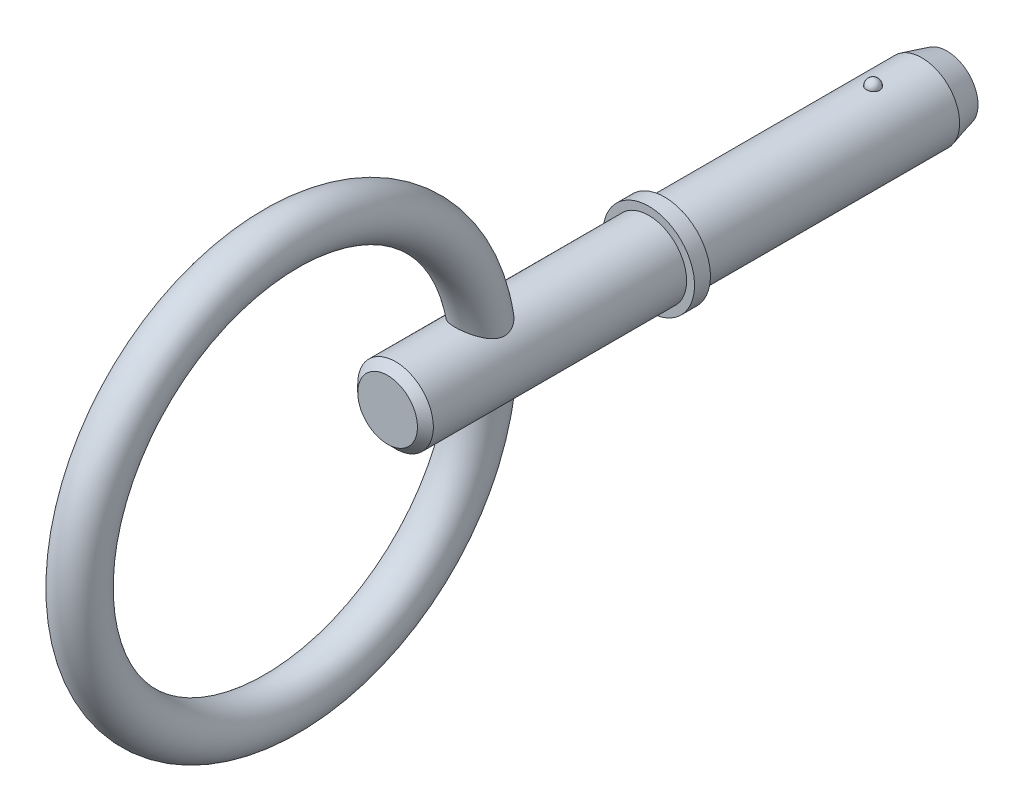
ISO-10303-21;
HEADER;
FILE_DESCRIPTION(('STEP AP214'),'2;1');
FILE_NAME('part.step','',(''),(''),'','','');
FILE_SCHEMA(('AUTOMOTIVE_DESIGN { 1 0 10303 214 1 1 1 1 }'));
ENDSEC;
DATA;
#1=APPLICATION_CONTEXT('core data for automotive mechanical design processes');
#2=APPLICATION_PROTOCOL_DEFINITION('international standard','automotive_design',2000,#1);
#3=PRODUCT_CONTEXT('',#1,'mechanical');
#4=PRODUCT('Part','Part','',(#3));
#5=PRODUCT_RELATED_PRODUCT_CATEGORY('part','',(#4));
#6=PRODUCT_DEFINITION_FORMATION('','',#4);
#7=PRODUCT_DEFINITION_CONTEXT('part definition',#1,'design');
#8=PRODUCT_DEFINITION('design','',#6,#7);
#9=PRODUCT_DEFINITION_SHAPE('','',#8);
#10=(LENGTH_UNIT() NAMED_UNIT(*) SI_UNIT(.MILLI.,.METRE.));
#11=(NAMED_UNIT(*) PLANE_ANGLE_UNIT() SI_UNIT($,.RADIAN.));
#12=(NAMED_UNIT(*) SI_UNIT($,.STERADIAN.) SOLID_ANGLE_UNIT());
#13=UNCERTAINTY_MEASURE_WITH_UNIT(LENGTH_MEASURE(1.E-05),#10,'distance_accuracy_value','');
#14=(GEOMETRIC_REPRESENTATION_CONTEXT(3) GLOBAL_UNCERTAINTY_ASSIGNED_CONTEXT((#13)) GLOBAL_UNIT_ASSIGNED_CONTEXT((#10,
#11,#12)) REPRESENTATION_CONTEXT('',''));
#15=CARTESIAN_POINT('',(0.,0.,0.));
#16=DIRECTION('',(0.,0.,1.));
#17=DIRECTION('',(1.,0.,0.));
#18=AXIS2_PLACEMENT_3D('',#15,#16,#17);
#19=CARTESIAN_POINT('',(0.,0.,12.7));
#20=DIRECTION('',(0.,0.,-1.));
#21=DIRECTION('',(-1.,0.,0.));
#22=AXIS2_PLACEMENT_3D('',#19,#20,#21);
#23=CYLINDRICAL_SURFACE('',#22,2.38);
#24=CARTESIAN_POINT('',(0.418361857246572,2.34294117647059,-0.419999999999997));
#25=CARTESIAN_POINT('',(0.418361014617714,2.34294160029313,-0.396453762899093));
#26=CARTESIAN_POINT('',(0.416399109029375,2.34329426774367,-0.372895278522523));
#27=CARTESIAN_POINT('',(0.408599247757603,2.34466666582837,-0.32643458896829));
#28=CARTESIAN_POINT('',(0.402757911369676,2.34568697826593,-0.303532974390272));
#29=CARTESIAN_POINT('',(0.387358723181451,2.3482789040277,-0.259059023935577));
#30=CARTESIAN_POINT('',(0.377802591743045,2.34985026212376,-0.237486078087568));
#31=CARTESIAN_POINT('',(0.355233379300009,2.35336760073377,-0.196270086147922));
#32=CARTESIAN_POINT('',(0.34222083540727,2.3553135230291,-0.176626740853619));
#33=CARTESIAN_POINT('',(0.313060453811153,2.35936636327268,-0.139777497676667));
#34=CARTESIAN_POINT('',(0.296906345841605,2.36147359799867,-0.122576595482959));
#35=CARTESIAN_POINT('',(0.261921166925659,2.3656092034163,-0.0911421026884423));
#36=CARTESIAN_POINT('',(0.243090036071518,2.36763757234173,-0.0769085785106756));
#37=CARTESIAN_POINT('',(0.203297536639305,2.37138533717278,-0.0518262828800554));
#38=CARTESIAN_POINT('',(0.182338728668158,2.37310509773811,-0.0409735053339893));
#39=CARTESIAN_POINT('',(0.138864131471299,2.37604521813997,-0.0229395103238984));
#40=CARTESIAN_POINT('',(0.116348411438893,2.37726560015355,-0.0157581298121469));
#41=CARTESIAN_POINT('',(0.0705754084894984,2.37906276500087,-0.00531205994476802));
#42=CARTESIAN_POINT('',(0.0473247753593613,2.37964420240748,-0.00201903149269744));
#43=CARTESIAN_POINT('',(0.000593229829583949,2.38011460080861,0.000651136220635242));
#44=CARTESIAN_POINT('',(-0.0228876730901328,2.38000359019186,2.84360175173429E-05));
#45=CARTESIAN_POINT('',(-0.0692686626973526,2.37910422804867,-0.00509943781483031));
#46=CARTESIAN_POINT('',(-0.0921713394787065,2.37831983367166,-0.00958192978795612));
#47=CARTESIAN_POINT('',(-0.136890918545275,2.37616546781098,-0.022272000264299));
#48=CARTESIAN_POINT('',(-0.158707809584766,2.37479549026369,-0.0304796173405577));
#49=CARTESIAN_POINT('',(-0.200704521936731,2.37161607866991,-0.0504168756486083));
#50=CARTESIAN_POINT('',(-0.220879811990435,2.36980547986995,-0.0621558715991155));
#51=CARTESIAN_POINT('',(-0.258974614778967,2.36594575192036,-0.0888218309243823));
#52=CARTESIAN_POINT('',(-0.276894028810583,2.36389661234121,-0.103748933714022));
#53=CARTESIAN_POINT('',(-0.310124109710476,2.35976825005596,-0.136509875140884));
#54=CARTESIAN_POINT('',(-0.325413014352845,2.35768891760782,-0.154365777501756));
#55=CARTESIAN_POINT('',(-0.352793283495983,2.35374782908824,-0.192402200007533));
#56=CARTESIAN_POINT('',(-0.364884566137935,2.35188607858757,-0.212582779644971));
#57=CARTESIAN_POINT('',(-0.385587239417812,2.34858114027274,-0.254794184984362));
#58=CARTESIAN_POINT('',(-0.394183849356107,2.34713973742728,-0.276832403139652));
#59=CARTESIAN_POINT('',(-0.407590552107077,2.3448489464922,-0.322061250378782));
#60=CARTESIAN_POINT('',(-0.412400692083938,2.34399955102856,-0.34525186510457));
#61=CARTESIAN_POINT('',(-0.418098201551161,2.34299005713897,-0.392078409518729));
#62=CARTESIAN_POINT('',(-0.41899328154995,2.34282860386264,-0.415713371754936));
#63=CARTESIAN_POINT('',(-0.416857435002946,2.34320955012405,-0.462799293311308));
#64=CARTESIAN_POINT('',(-0.413826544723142,2.34375194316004,-0.486250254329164));
#65=CARTESIAN_POINT('',(-0.403929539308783,2.34547773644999,-0.532261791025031));
#66=CARTESIAN_POINT('',(-0.397069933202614,2.34666004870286,-0.554823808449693));
#67=CARTESIAN_POINT('',(-0.379705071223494,2.34953208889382,-0.59846383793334));
#68=CARTESIAN_POINT('',(-0.369199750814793,2.35122182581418,-0.61954182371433));
#69=CARTESIAN_POINT('',(-0.344797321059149,2.35492396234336,-0.659671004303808));
#70=CARTESIAN_POINT('',(-0.33089223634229,2.35693711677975,-0.678717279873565));
#71=CARTESIAN_POINT('',(-0.300080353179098,2.36105754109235,-0.714192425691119));
#72=CARTESIAN_POINT('',(-0.283173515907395,2.36316481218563,-0.730621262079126));
#73=CARTESIAN_POINT('',(-0.246801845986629,2.36723962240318,-0.760416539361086));
#74=CARTESIAN_POINT('',(-0.227334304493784,2.36920701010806,-0.773779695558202));
#75=CARTESIAN_POINT('',(-0.186398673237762,2.37277833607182,-0.797042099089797));
#76=CARTESIAN_POINT('',(-0.164930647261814,2.37438228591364,-0.806941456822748));
#77=CARTESIAN_POINT('',(-0.120727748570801,2.37703848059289,-0.82294821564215));
#78=CARTESIAN_POINT('',(-0.0980005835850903,2.37809374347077,-0.829076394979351));
#79=CARTESIAN_POINT('',(-0.0518218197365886,2.37954782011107,-0.837451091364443));
#80=CARTESIAN_POINT('',(-0.0283702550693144,2.37994666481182,-0.839697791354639));
#81=CARTESIAN_POINT('',(0.0184023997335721,2.38004290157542,-0.840243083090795));
#82=CARTESIAN_POINT('',(0.0417231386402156,2.37974556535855,-0.838571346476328));
#83=CARTESIAN_POINT('',(0.0877471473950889,2.37849333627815,-0.831389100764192));
#84=CARTESIAN_POINT('',(0.110450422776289,2.37753844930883,-0.825878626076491));
#85=CARTESIAN_POINT('',(0.154584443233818,2.37507730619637,-0.811179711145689));
#86=CARTESIAN_POINT('',(0.17601599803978,2.37357140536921,-0.801993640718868));
#87=CARTESIAN_POINT('',(0.217028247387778,2.37017355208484,-0.780200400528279));
#88=CARTESIAN_POINT('',(0.236608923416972,2.36828159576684,-0.767593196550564));
#89=CARTESIAN_POINT('',(0.27351405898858,2.36430486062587,-0.739207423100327));
#90=CARTESIAN_POINT('',(0.290821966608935,2.36221883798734,-0.723407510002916));
#91=CARTESIAN_POINT('',(0.322554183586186,2.3580957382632,-0.68912612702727));
#92=CARTESIAN_POINT('',(0.336977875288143,2.35605867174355,-0.670644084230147));
#93=CARTESIAN_POINT('',(0.362636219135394,2.35224677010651,-0.63138169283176));
#94=CARTESIAN_POINT('',(0.373848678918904,2.35047379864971,-0.610586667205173));
#95=CARTESIAN_POINT('',(0.392641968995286,2.34740786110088,-0.567397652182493));
#96=CARTESIAN_POINT('',(0.400225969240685,2.34611447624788,-0.545005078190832));
#97=CARTESIAN_POINT('',(0.410033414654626,2.34441668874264,-0.505456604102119));
#98=CARTESIAN_POINT('',(0.413152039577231,2.34386644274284,-0.488523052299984));
#99=CARTESIAN_POINT('',(0.417316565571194,2.34312853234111,-0.454395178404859));
#100=CARTESIAN_POINT('',(0.418362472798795,2.34294086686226,-0.437200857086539));
#101=CARTESIAN_POINT('',(0.418361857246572,2.34294117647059,-0.419999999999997));
#102=B_SPLINE_CURVE_WITH_KNOTS('',3,(#24,#25,#26,#27,#28,#29,#30,#31,#32,#33,#34,#35,#36,#37,
#38,#39,#40,#41,#42,#43,#44,#45,#46,#47,#48,#49,#50,#51,#52,#53,#54,#55,#56,#57,#58,#59,#60,#61,
#62,#63,#64,#65,#66,#67,#68,#69,#70,#71,#72,#73,#74,#75,#76,#77,#78,#79,#80,#81,#82,#83,#84,#85,
#86,#87,#88,#89,#90,#91,#92,#93,#94,#95,#96,#97,#98,#99,#100,#101),.UNSPECIFIED.,.T.,.F.,(4,2,2,
2,2,2,2,2,2,2,2,2,2,2,2,2,2,2,2,2,2,2,2,2,2,2,2,2,2,2,2,2,2,2,2,2,2,2,4),(0.,0.0705763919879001,
0.141214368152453,0.211819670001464,0.282414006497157,0.353150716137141,0.423889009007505,
0.494543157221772,0.565194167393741,0.635327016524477,0.705456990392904,0.77517764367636,
0.844899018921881,0.914806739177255,0.98471751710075,1.05518143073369,1.1256471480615,
1.19640787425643,1.26716771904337,1.33778814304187,1.40840791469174,1.47890799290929,
1.54940931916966,1.62007764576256,1.69074688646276,1.76149149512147,1.83223384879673,
1.90258285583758,1.97292854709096,2.04274328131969,2.11255738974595,2.18232655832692,
2.25209642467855,2.32234913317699,2.39261687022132,2.4633591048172,2.5340394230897,
2.58559662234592,2.63715366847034),.UNSPECIFIED.);
#103=CARTESIAN_POINT('',(0.418361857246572,2.34294117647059,-0.419999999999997));
#104=VERTEX_POINT('',#103);
#105=EDGE_CURVE('E102',#104,#104,#102,.T.);
#106=ORIENTED_EDGE('',*,*,#105,.T.);
#107=EDGE_LOOP('',(#106));
#108=FACE_BOUND('',#107,.T.);
#109=CARTESIAN_POINT('',(0.,0.,-3.49399999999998));
#110=DIRECTION('',(0.,0.,-1.));
#111=DIRECTION('',(-1.,0.,0.));
#112=AXIS2_PLACEMENT_3D('',#109,#110,#111);
#113=CIRCLE('',#112,2.38);
#114=CARTESIAN_POINT('',(-2.38,0.,-3.49399999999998));
#115=VERTEX_POINT('',#114);
#116=EDGE_CURVE('E110',#115,#115,#113,.F.);
#117=ORIENTED_EDGE('',*,*,#116,.T.);
#118=EDGE_LOOP('',(#117));
#119=FACE_BOUND('',#118,.T.);
#120=CARTESIAN_POINT('',(0.,0.,12.7));
#121=DIRECTION('',(0.,0.,1.));
#122=DIRECTION('',(1.,0.,0.));
#123=AXIS2_PLACEMENT_3D('',#120,#121,#122);
#124=CIRCLE('',#123,2.38);
#125=CARTESIAN_POINT('',(2.38,0.,12.7));
#126=VERTEX_POINT('',#125);
#127=EDGE_CURVE('E108',#126,#126,#124,.T.);
#128=ORIENTED_EDGE('',*,*,#127,.F.);
#129=EDGE_LOOP('',(#128));
#130=FACE_BOUND('',#129,.T.);
#131=ADVANCED_FACE('F39',(#108,#119,#130),#23,.T.);
#132=CARTESIAN_POINT('',(0.,0.,-5.08));
#133=DIRECTION('',(0.,0.,-1.));
#134=DIRECTION('',(-1.,0.,0.));
#135=AXIS2_PLACEMENT_3D('',#132,#133,#134);
#136=PLANE('',#135);
#137=CARTESIAN_POINT('',(0.,0.,-5.08));
#138=DIRECTION('',(0.,0.,-1.));
#139=DIRECTION('',(-1.,0.,0.));
#140=AXIS2_PLACEMENT_3D('',#137,#138,#139);
#141=CIRCLE('',#140,1.95503258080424);
#142=CARTESIAN_POINT('',(-1.95503258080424,0.,-5.08));
#143=VERTEX_POINT('',#142);
#144=EDGE_CURVE('E142',#143,#143,#141,.T.);
#145=ORIENTED_EDGE('',*,*,#144,.T.);
#146=EDGE_LOOP('',(#145));
#147=FACE_BOUND('',#146,.T.);
#148=ADVANCED_FACE('F88',(#147),#136,.T.);
#149=CARTESIAN_POINT('',(0.,0.,-5.08));
#150=DIRECTION('',(0.,0.,1.));
#151=DIRECTION('',(1.,0.,0.));
#152=AXIS2_PLACEMENT_3D('',#149,#150,#151);
#153=CONICAL_SURFACE('',#152,1.95503258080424,0.261799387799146);
#154=ORIENTED_EDGE('',*,*,#116,.F.);
#155=EDGE_LOOP('',(#154));
#156=FACE_BOUND('',#155,.T.);
#157=ORIENTED_EDGE('',*,*,#144,.F.);
#158=EDGE_LOOP('',(#157));
#159=FACE_BOUND('',#158,.T.);
#160=ADVANCED_FACE('F94',(#156,#159),#153,.T.);
#161=CARTESIAN_POINT('',(0.,2.38,-0.419999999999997));
#162=DIRECTION('',(0.,1.,0.));
#163=DIRECTION('',(0.,0.,1.));
#164=AXIS2_PLACEMENT_3D('',#161,#162,#163);
#165=SPHERICAL_SURFACE('',#164,0.419999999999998);
#166=ORIENTED_EDGE('',*,*,#105,.F.);
#167=EDGE_LOOP('',(#166));
#168=FACE_BOUND('',#167,.T.);
#169=ADVANCED_FACE('F113',(#168),#165,.T.);
#170=CARTESIAN_POINT('',(0.,0.,12.7));
#171=DIRECTION('',(0.,0.,-1.));
#172=DIRECTION('',(-1.,0.,0.));
#173=AXIS2_PLACEMENT_3D('',#170,#171,#172);
#174=PLANE('',#173);
#175=ORIENTED_EDGE('',*,*,#127,.T.);
#176=EDGE_LOOP('',(#175));
#177=FACE_BOUND('',#176,.T.);
#178=CARTESIAN_POINT('',(0.,0.,12.7));
#179=DIRECTION('',(0.,0.,-1.));
#180=DIRECTION('',(-1.,0.,0.));
#181=AXIS2_PLACEMENT_3D('',#178,#179,#180);
#182=CIRCLE('',#181,2.88);
#183=CARTESIAN_POINT('',(-2.88,0.,12.7));
#184=VERTEX_POINT('',#183);
#185=EDGE_CURVE('E109',#184,#184,#182,.T.);
#186=ORIENTED_EDGE('',*,*,#185,.T.);
#187=EDGE_LOOP('',(#186));
#188=FACE_BOUND('',#187,.T.);
#189=ADVANCED_FACE('F117',(#177,#188),#174,.T.);
#190=CARTESIAN_POINT('',(0.,0.,33.7287874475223));
#191=DIRECTION('',(0.,0.,-1.));
#192=DIRECTION('',(-1.,0.,0.));
#193=AXIS2_PLACEMENT_3D('',#190,#191,#192);
#194=CYLINDRICAL_SURFACE('',#193,2.88);
#195=CARTESIAN_POINT('',(0.,0.,13.7));
#196=DIRECTION('',(0.,0.,-1.));
#197=DIRECTION('',(-1.,0.,0.));
#198=AXIS2_PLACEMENT_3D('',#195,#196,#197);
#199=CIRCLE('',#198,2.88);
#200=CARTESIAN_POINT('',(-2.88,0.,13.7));
#201=VERTEX_POINT('',#200);
#202=EDGE_CURVE('E134',#201,#201,#199,.T.);
#203=ORIENTED_EDGE('',*,*,#202,.T.);
#204=EDGE_LOOP('',(#203));
#205=FACE_BOUND('',#204,.T.);
#206=ORIENTED_EDGE('',*,*,#185,.F.);
#207=EDGE_LOOP('',(#206));
#208=FACE_BOUND('',#207,.T.);
#209=ADVANCED_FACE('F121',(#205,#208),#194,.T.);
#210=CARTESIAN_POINT('',(0.,2.88,13.7));
#211=DIRECTION('',(0.,0.,1.));
#212=DIRECTION('',(1.,0.,0.));
#213=AXIS2_PLACEMENT_3D('',#210,#211,#212);
#214=PLANE('',#213);
#215=CARTESIAN_POINT('',(0.,0.,13.7));
#216=DIRECTION('',(0.,0.,1.));
#217=DIRECTION('',(1.,0.,0.));
#218=AXIS2_PLACEMENT_3D('',#215,#216,#217);
#219=CIRCLE('',#218,2.38);
#220=CARTESIAN_POINT('',(2.38,0.,13.7));
#221=VERTEX_POINT('',#220);
#222=EDGE_CURVE('E112',#221,#221,#219,.T.);
#223=ORIENTED_EDGE('',*,*,#222,.F.);
#224=EDGE_LOOP('',(#223));
#225=FACE_BOUND('',#224,.T.);
#226=ORIENTED_EDGE('',*,*,#202,.F.);
#227=EDGE_LOOP('',(#226));
#228=FACE_BOUND('',#227,.T.);
#229=ADVANCED_FACE('F85',(#225,#228),#214,.T.);
#230=CARTESIAN_POINT('',(0.,0.,30.15));
#231=DIRECTION('',(0.,0.,-1.));
#232=DIRECTION('',(-1.,0.,0.));
#233=AXIS2_PLACEMENT_3D('',#230,#231,#232);
#234=CYLINDRICAL_SURFACE('',#233,2.38);
#235=CARTESIAN_POINT('',(-0.903407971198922,-2.20187511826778,23.128101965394));
#236=CARTESIAN_POINT('',(-0.839710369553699,-2.22800560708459,23.0836275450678));
#237=CARTESIAN_POINT('',(-0.771955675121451,-2.25255828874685,23.0439200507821));
#238=CARTESIAN_POINT('',(-0.629623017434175,-2.29641711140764,22.9749006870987));
#239=CARTESIAN_POINT('',(-0.555034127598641,-2.31571464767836,22.9456058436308));
#240=CARTESIAN_POINT('',(-0.40067374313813,-2.34735542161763,22.8982943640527));
#241=CARTESIAN_POINT('',(-0.320887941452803,-2.35967847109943,22.8803104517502));
#242=CARTESIAN_POINT('',(-0.158738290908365,-2.37609587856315,22.8564617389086));
#243=CARTESIAN_POINT('',(-0.0763765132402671,-2.38019668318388,22.8505874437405));
#244=CARTESIAN_POINT('',(0.0836658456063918,-2.3797998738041,22.8511603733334));
#245=CARTESIAN_POINT('',(0.161351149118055,-2.37576936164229,22.8569382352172));
#246=CARTESIAN_POINT('',(0.314409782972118,-2.36039486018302,22.8792676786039));
#247=CARTESIAN_POINT('',(0.389782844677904,-2.34905002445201,22.8958205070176));
#248=CARTESIAN_POINT('',(0.535937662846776,-2.32006569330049,22.9390515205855));
#249=CARTESIAN_POINT('',(0.606735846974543,-2.30245039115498,22.9656908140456));
#250=CARTESIAN_POINT('',(0.742521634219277,-2.26231731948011,23.0283720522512));
#251=CARTESIAN_POINT('',(0.807508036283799,-2.23979853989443,23.0644159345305));
#252=CARTESIAN_POINT('',(0.935326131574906,-2.18966592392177,23.1483563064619));
#253=CARTESIAN_POINT('',(0.997591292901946,-2.16179128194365,23.1969595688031));
#254=CARTESIAN_POINT('',(1.11292144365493,-2.10474548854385,23.303560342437));
#255=CARTESIAN_POINT('',(1.16597568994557,-2.07557287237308,23.3615686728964));
#256=CARTESIAN_POINT('',(1.26477130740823,-2.01699124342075,23.4902977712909));
#257=CARTESIAN_POINT('',(1.30983402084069,-1.98768494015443,23.5615920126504));
#258=CARTESIAN_POINT('',(1.38660631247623,-1.93491744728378,23.7129637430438));
#259=CARTESIAN_POINT('',(1.41834090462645,-1.91144534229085,23.7930244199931));
#260=CARTESIAN_POINT('',(1.46422131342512,-1.87648847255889,23.9506940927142));
#261=CARTESIAN_POINT('',(1.47990731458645,-1.86397592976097,24.0276190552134));
#262=CARTESIAN_POINT('',(1.49871691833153,-1.84889326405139,24.1838974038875));
#263=CARTESIAN_POINT('',(1.50185388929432,-1.84631256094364,24.2632481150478));
#264=CARTESIAN_POINT('',(1.4964844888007,-1.85065563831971,24.4088470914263));
#265=CARTESIAN_POINT('',(1.48970686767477,-1.85616871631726,24.4752204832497));
#266=CARTESIAN_POINT('',(1.46828795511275,-1.87315650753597,24.6059075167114));
#267=CARTESIAN_POINT('',(1.4536391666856,-1.88463690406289,24.6702191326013));
#268=CARTESIAN_POINT('',(1.40943250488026,-1.91806137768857,24.8230643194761));
#269=CARTESIAN_POINT('',(1.37616344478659,-1.94238425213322,24.9099991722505));
#270=CARTESIAN_POINT('',(1.29708737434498,-1.99605834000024,25.0763485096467));
#271=CARTESIAN_POINT('',(1.25125268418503,-2.02542060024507,25.155745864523));
#272=CARTESIAN_POINT('',(1.14695036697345,-2.08629729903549,25.3076285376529));
#273=CARTESIAN_POINT('',(1.08823347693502,-2.11784433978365,25.3799296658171));
#274=CARTESIAN_POINT('',(0.959228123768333,-2.17930599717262,25.5140708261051));
#275=CARTESIAN_POINT('',(0.8889586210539,-2.20922318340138,25.5759276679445));
#276=CARTESIAN_POINT('',(0.753368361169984,-2.25851185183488,25.6749333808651));
#277=CARTESIAN_POINT('',(0.690173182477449,-2.2787729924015,25.7145392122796));
#278=CARTESIAN_POINT('',(0.557409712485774,-2.31482439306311,25.7839846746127));
#279=CARTESIAN_POINT('',(0.487846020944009,-2.3306178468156,25.8138312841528));
#280=CARTESIAN_POINT('',(0.342953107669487,-2.35631858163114,25.8620255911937));
#281=CARTESIAN_POINT('',(0.267574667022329,-2.36616750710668,25.880259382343));
#282=CARTESIAN_POINT('',(0.114199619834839,-2.37849775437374,25.9030468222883));
#283=CARTESIAN_POINT('',(0.0362059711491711,-2.3809871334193,25.9076154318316));
#284=CARTESIAN_POINT('',(-0.107568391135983,-2.37849121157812,25.9030163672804));
#285=CARTESIAN_POINT('',(-0.17344035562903,-2.37456249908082,25.895790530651));
#286=CARTESIAN_POINT('',(-0.302853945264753,-2.36154811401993,25.8716908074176));
#287=CARTESIAN_POINT('',(-0.366395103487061,-2.35246141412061,25.8548149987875));
#288=CARTESIAN_POINT('',(-0.489880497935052,-2.32988758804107,25.8124346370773));
#289=CARTESIAN_POINT('',(-0.549812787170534,-2.31638670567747,25.7869031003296));
#290=CARTESIAN_POINT('',(-0.665021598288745,-2.28597979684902,25.728489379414));
#291=CARTESIAN_POINT('',(-0.720295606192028,-2.26907194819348,25.6956032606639));
#292=CARTESIAN_POINT('',(-0.85113270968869,-2.22413718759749,25.6063110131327));
#293=CARTESIAN_POINT('',(-0.923680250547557,-2.19467168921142,25.5461969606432));
#294=CARTESIAN_POINT('',(-1.05722916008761,-2.13356097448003,25.4150668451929));
#295=CARTESIAN_POINT('',(-1.11820078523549,-2.10191042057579,25.3440235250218));
#296=CARTESIAN_POINT('',(-1.22894457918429,-2.0391654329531,25.1916118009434));
#297=CARTESIAN_POINT('',(-1.27853191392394,-2.0080868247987,25.1101025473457));
#298=CARTESIAN_POINT('',(-1.36422650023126,-1.95088121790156,24.9387530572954));
#299=CARTESIAN_POINT('',(-1.40036235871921,-1.92474376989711,24.8489310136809));
#300=CARTESIAN_POINT('',(-1.44943039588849,-1.88791548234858,24.6877392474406));
#301=CARTESIAN_POINT('',(-1.46600167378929,-1.87495651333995,24.6180059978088));
#302=CARTESIAN_POINT('',(-1.48984634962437,-1.8560704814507,24.4760551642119));
#303=CARTESIAN_POINT('',(-1.49713400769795,-1.85013263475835,24.403841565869));
#304=CARTESIAN_POINT('',(-1.5014924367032,-1.84660099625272,24.2583634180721));
#305=CARTESIAN_POINT('',(-1.4984943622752,-1.84906342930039,24.1850950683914));
#306=CARTESIAN_POINT('',(-1.48179888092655,-1.8624661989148,24.0405680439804));
#307=CARTESIAN_POINT('',(-1.46809860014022,-1.87340881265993,23.969309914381));
#308=CARTESIAN_POINT('',(-1.43218989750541,-1.90096973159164,23.8372815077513));
#309=CARTESIAN_POINT('',(-1.410850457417,-1.91699396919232,23.7761429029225));
#310=CARTESIAN_POINT('',(-1.36038958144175,-1.95312601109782,23.6584385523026));
#311=CARTESIAN_POINT('',(-1.33126141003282,-1.97323734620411,23.6018768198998));
#312=CARTESIAN_POINT('',(-1.2617310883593,-2.01850590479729,23.4870500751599));
#313=CARTESIAN_POINT('',(-1.22036168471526,-2.04397945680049,23.4294985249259));
#314=CARTESIAN_POINT('',(-1.1295425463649,-2.09553139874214,23.3216488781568));
#315=CARTESIAN_POINT('',(-1.08010424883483,-2.12160888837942,23.2713407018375));
#316=CARTESIAN_POINT('',(-0.987769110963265,-2.16578285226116,23.1904848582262));
#317=CARTESIAN_POINT('',(-0.946517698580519,-2.18419033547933,23.1582016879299));
#318=CARTESIAN_POINT('',(-0.903407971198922,-2.20187511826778,23.128101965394));
#319=B_SPLINE_CURVE_WITH_KNOTS('',3,(#235,#236,#237,#238,#239,#240,#241,#242,#243,#244,#245,
#246,#247,#248,#249,#250,#251,#252,#253,#254,#255,#256,#257,#258,#259,#260,#261,#262,#263,#264,
#265,#266,#267,#268,#269,#270,#271,#272,#273,#274,#275,#276,#277,#278,#279,#280,#281,#282,#283,
#284,#285,#286,#287,#288,#289,#290,#291,#292,#293,#294,#295,#296,#297,#298,#299,#300,#301,#302,
#303,#304,#305,#306,#307,#308,#309,#310,#311,#312,#313,#314,#315,#316,#317,#318),.UNSPECIFIED.,
.T.,.F.,(4,2,2,2,2,2,2,2,2,2,2,2,2,2,2,2,2,2,2,2,2,2,2,2,2,2,2,2,2,2,2,2,2,2,2,2,2,2,2,2,2,4),
(0.,0.245727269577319,0.491854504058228,0.738690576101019,0.985333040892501,1.21821047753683,
1.45111486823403,1.68313021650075,1.91519340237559,2.16541572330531,2.41592795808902,
2.68235417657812,2.94827811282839,3.18521517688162,3.42189976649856,3.62191159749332,
3.82211427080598,4.1091894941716,4.39690224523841,4.69076958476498,4.98415935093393,
5.2151557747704,5.44598665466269,5.67904815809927,5.91185441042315,6.11003726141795,
6.3082595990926,6.50710565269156,6.70605834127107,7.00062466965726,7.29593791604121,
7.59575158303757,7.8949239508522,8.11262207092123,8.329985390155,8.548806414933,
8.76768621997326,8.96702101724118,9.1665287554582,9.39164791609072,9.61645071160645,
9.78275580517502),.UNSPECIFIED.);
#320=CARTESIAN_POINT('',(-0.903407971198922,-2.20187511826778,23.128101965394));
#321=VERTEX_POINT('',#320);
#322=EDGE_CURVE('E10',#321,#321,#319,.T.);
#323=ORIENTED_EDGE('',*,*,#322,.F.);
#324=EDGE_LOOP('',(#323));
#325=FACE_BOUND('',#324,.T.);
#326=CARTESIAN_POINT('',(-0.903407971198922,2.20187511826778,23.128101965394));
#327=CARTESIAN_POINT('',(-0.970214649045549,2.17445928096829,23.1747550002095));
#328=CARTESIAN_POINT('',(-1.03268838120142,2.14525344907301,23.2267440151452));
#329=CARTESIAN_POINT('',(-1.1477077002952,2.0859961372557,23.3406478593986));
#330=CARTESIAN_POINT('',(-1.20022114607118,2.05594226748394,23.4025936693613));
#331=CARTESIAN_POINT('',(-1.2941155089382,1.99817720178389,23.5359266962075));
#332=CARTESIAN_POINT('',(-1.33544720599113,1.9704767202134,23.6073536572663));
#333=CARTESIAN_POINT('',(-1.40506760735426,1.92146090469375,23.7582024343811));
#334=CARTESIAN_POINT('',(-1.43339046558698,1.90012890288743,23.8376026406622));
#335=CARTESIAN_POINT('',(-1.47338334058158,1.86925714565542,23.9934496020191));
#336=CARTESIAN_POINT('',(-1.48649837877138,1.85870842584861,24.0693198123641));
#337=CARTESIAN_POINT('',(-1.50071746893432,1.8472518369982,24.22287045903));
#338=CARTESIAN_POINT('',(-1.50182784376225,1.84633889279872,24.3005499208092));
#339=CARTESIAN_POINT('',(-1.49326645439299,1.85325786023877,24.443985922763));
#340=CARTESIAN_POINT('',(-1.48506604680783,1.85989666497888,24.5099043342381));
#341=CARTESIAN_POINT('',(-1.46099386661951,1.87886395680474,24.6394790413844));
#342=CARTESIAN_POINT('',(-1.44511553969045,1.8911973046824,24.7031333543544));
#343=CARTESIAN_POINT('',(-1.39754250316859,1.92678855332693,24.8561538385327));
#344=CARTESIAN_POINT('',(-1.36192725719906,1.95245999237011,24.9437372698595));
#345=CARTESIAN_POINT('',(-1.27788657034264,2.00847209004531,25.1109907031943));
#346=CARTESIAN_POINT('',(-1.22943137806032,2.03882352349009,25.1906417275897));
#347=CARTESIAN_POINT('',(-1.11958027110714,2.10119412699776,25.3424206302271));
#348=CARTESIAN_POINT('',(-1.05794784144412,2.13323438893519,25.4143690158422));
#349=CARTESIAN_POINT('',(-0.922772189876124,2.19508493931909,25.5470807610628));
#350=CARTESIAN_POINT('',(-0.849252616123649,2.22489948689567,25.6078658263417));
#351=CARTESIAN_POINT('',(-0.710152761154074,2.27246326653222,25.7023110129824));
#352=CARTESIAN_POINT('',(-0.647015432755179,2.29138112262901,25.7389704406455));
#353=CARTESIAN_POINT('',(-0.514878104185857,2.32463484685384,25.8025884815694));
#354=CARTESIAN_POINT('',(-0.445882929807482,2.3389744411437,25.8295549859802));
#355=CARTESIAN_POINT('',(-0.302797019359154,2.36177853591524,25.8721624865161));
#356=CARTESIAN_POINT('',(-0.228666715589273,2.37019011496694,25.8877015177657));
#357=CARTESIAN_POINT('',(-0.0783799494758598,2.37989644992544,25.9056164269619));
#358=CARTESIAN_POINT('',(-0.00222521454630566,2.38119708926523,25.9080031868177));
#359=CARTESIAN_POINT('',(0.138818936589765,2.37685303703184,25.8999981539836));
#360=CARTESIAN_POINT('',(0.203841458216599,2.37212211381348,25.8912876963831));
#361=CARTESIAN_POINT('',(0.331347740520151,2.3576952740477,25.8645309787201));
#362=CARTESIAN_POINT('',(0.393830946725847,2.34799827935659,25.8464826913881));
#363=CARTESIAN_POINT('',(0.516206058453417,2.32419976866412,25.8016833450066));
#364=CARTESIAN_POINT('',(0.576015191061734,2.31000942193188,25.7747562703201));
#365=CARTESIAN_POINT('',(0.690806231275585,2.27831963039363,25.7136110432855));
#366=CARTESIAN_POINT('',(0.74578539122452,2.26081831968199,25.679388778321));
#367=CARTESIAN_POINT('',(0.876071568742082,2.21443701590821,25.5866108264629));
#368=CARTESIAN_POINT('',(0.948236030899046,2.18416686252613,25.524322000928));
#369=CARTESIAN_POINT('',(1.08068664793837,2.121767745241,25.3888044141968));
#370=CARTESIAN_POINT('',(1.14094076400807,2.08963406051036,25.315547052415));
#371=CARTESIAN_POINT('',(1.24978363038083,2.02643655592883,25.158659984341));
#372=CARTESIAN_POINT('',(1.29819307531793,1.99539463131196,25.0748968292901));
#373=CARTESIAN_POINT('',(1.38094965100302,1.93904233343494,24.8989962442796));
#374=CARTESIAN_POINT('',(1.41533296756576,1.91371728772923,24.8068811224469));
#375=CARTESIAN_POINT('',(1.46011713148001,1.879629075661,24.643926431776));
#376=CARTESIAN_POINT('',(1.47459501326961,1.86818653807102,24.5747778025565));
#377=CARTESIAN_POINT('',(1.49436605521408,1.8524142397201,24.434403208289));
#378=CARTESIAN_POINT('',(1.49967306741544,1.84807375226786,24.3631805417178));
#379=CARTESIAN_POINT('',(1.50029887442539,1.84756805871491,24.2202291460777));
#380=CARTESIAN_POINT('',(1.49556248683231,1.8514480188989,24.148499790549));
#381=CARTESIAN_POINT('',(1.4758165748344,1.86722196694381,24.0073512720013));
#382=CARTESIAN_POINT('',(1.46080121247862,1.87912050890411,23.9379334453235));
#383=CARTESIAN_POINT('',(1.42246467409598,1.90827733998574,23.8082199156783));
#384=CARTESIAN_POINT('',(1.39980172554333,1.92509995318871,23.7476260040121));
#385=CARTESIAN_POINT('',(1.34679091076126,1.96255086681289,23.6311857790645));
#386=CARTESIAN_POINT('',(1.31644034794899,1.98318050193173,23.5753411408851));
#387=CARTESIAN_POINT('',(1.24396057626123,2.02954647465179,23.4614514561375));
#388=CARTESIAN_POINT('',(1.20077385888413,2.05559269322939,23.4042068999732));
#389=CARTESIAN_POINT('',(1.1061641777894,2.10801594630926,23.2971320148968));
#390=CARTESIAN_POINT('',(1.05473535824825,2.13439320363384,23.2473070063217));
#391=CARTESIAN_POINT('',(0.936202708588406,2.18924478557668,23.1487347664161));
#392=CARTESIAN_POINT('',(0.867904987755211,2.2174445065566,23.1012583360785));
#393=CARTESIAN_POINT('',(0.722917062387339,2.26885521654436,23.0177494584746));
#394=CARTESIAN_POINT('',(0.646227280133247,2.2920664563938,22.9817164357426));
#395=CARTESIAN_POINT('',(0.487515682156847,2.33094430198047,22.922591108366));
#396=CARTESIAN_POINT('',(0.405587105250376,2.34671524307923,22.8993190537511));
#397=CARTESIAN_POINT('',(0.237955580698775,2.36958127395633,22.8658521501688));
#398=CARTESIAN_POINT('',(0.152255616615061,2.37668309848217,22.8556471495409));
#399=CARTESIAN_POINT('',(-0.0122990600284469,2.38126478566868,22.8490505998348));
#400=CARTESIAN_POINT('',(-0.0910885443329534,2.37954037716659,22.8515167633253));
#401=CARTESIAN_POINT('',(-0.247004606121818,2.36843740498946,22.8675699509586));
#402=CARTESIAN_POINT('',(-0.324130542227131,2.35905594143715,22.8811611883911));
#403=CARTESIAN_POINT('',(-0.47304809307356,2.33371594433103,22.9185984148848));
#404=CARTESIAN_POINT('',(-0.54491402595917,2.31788812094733,22.9422409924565));
#405=CARTESIAN_POINT('',(-0.683201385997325,2.28095222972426,22.9990265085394));
#406=CARTESIAN_POINT('',(-0.749631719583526,2.25985303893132,23.0321534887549));
#407=CARTESIAN_POINT('',(-0.843767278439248,2.22565914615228,23.0880726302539));
#408=CARTESIAN_POINT('',(-0.874007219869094,2.21394047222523,23.1075705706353));
#409=CARTESIAN_POINT('',(-0.903407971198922,2.20187511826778,23.128101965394));
#410=B_SPLINE_CURVE_WITH_KNOTS('',3,(#326,#327,#328,#329,#330,#331,#332,#333,#334,#335,#336,
#337,#338,#339,#340,#341,#342,#343,#344,#345,#346,#347,#348,#349,#350,#351,#352,#353,#354,#355,
#356,#357,#358,#359,#360,#361,#362,#363,#364,#365,#366,#367,#368,#369,#370,#371,#372,#373,#374,
#375,#376,#377,#378,#379,#380,#381,#382,#383,#384,#385,#386,#387,#388,#389,#390,#391,#392,#393,
#394,#395,#396,#397,#398,#399,#400,#401,#402,#403,#404,#405,#406,#407,#408,#409),.UNSPECIFIED.,
.T.,.F.,(4,2,2,2,2,2,2,2,2,2,2,2,2,2,2,2,2,2,2,2,2,2,2,2,2,2,2,2,2,2,2,2,2,2,2,2,2,2,2,2,2,4),
(0.,0.257815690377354,0.516449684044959,0.776204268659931,1.03527292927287,1.26692758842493,
1.49846022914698,1.69794041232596,1.89759118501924,2.18993090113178,2.48295401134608,
2.78175997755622,3.07997865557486,3.30539912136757,3.53063565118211,3.75785831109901,
3.98489294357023,4.18128296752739,4.37771564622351,4.57830350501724,4.77900474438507,
5.07746482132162,5.37671714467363,5.68025255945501,5.98299985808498,6.19688795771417,
6.41045270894,6.62519390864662,6.84005717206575,7.03981304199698,7.23963907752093,
7.46764796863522,7.69581957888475,7.95804669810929,8.22026062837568,8.47867938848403,
8.73689726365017,8.97226876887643,9.20772945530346,9.43863631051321,9.669156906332,
9.7826182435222),.UNSPECIFIED.);
#411=CARTESIAN_POINT('',(-0.903407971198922,2.20187511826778,23.128101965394));
#412=VERTEX_POINT('',#411);
#413=EDGE_CURVE('E51',#412,#412,#410,.T.);
#414=ORIENTED_EDGE('',*,*,#413,.F.);
#415=EDGE_LOOP('',(#414));
#416=FACE_BOUND('',#415,.T.);
#417=CARTESIAN_POINT('',(0.,0.,29.65));
#418=DIRECTION('',(0.,0.,-1.));
#419=DIRECTION('',(-1.,0.,0.));
#420=AXIS2_PLACEMENT_3D('',#417,#418,#419);
#421=CIRCLE('',#420,2.38);
#422=CARTESIAN_POINT('',(-2.38,0.,29.65));
#423=VERTEX_POINT('',#422);
#424=EDGE_CURVE('E64',#423,#423,#421,.T.);
#425=ORIENTED_EDGE('',*,*,#424,.T.);
#426=EDGE_LOOP('',(#425));
#427=FACE_BOUND('',#426,.T.);
#428=ORIENTED_EDGE('',*,*,#222,.T.);
#429=EDGE_LOOP('',(#428));
#430=FACE_BOUND('',#429,.T.);
#431=ADVANCED_FACE('F69',(#325,#416,#427,#430),#234,.T.);
#432=CARTESIAN_POINT('',(0.,0.,30.15));
#433=DIRECTION('',(0.,0.,-1.));
#434=DIRECTION('',(-1.,0.,0.));
#435=AXIS2_PLACEMENT_3D('',#432,#433,#434);
#436=PLANE('',#435);
#437=CARTESIAN_POINT('',(0.,0.,30.15));
#438=DIRECTION('',(0.,0.,-1.));
#439=DIRECTION('',(-1.,0.,0.));
#440=AXIS2_PLACEMENT_3D('',#437,#438,#439);
#441=CIRCLE('',#440,1.87999999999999);
#442=CARTESIAN_POINT('',(-1.87999999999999,0.,30.15));
#443=VERTEX_POINT('',#442);
#444=EDGE_CURVE('E58',#443,#443,#441,.F.);
#445=ORIENTED_EDGE('',*,*,#444,.T.);
#446=EDGE_LOOP('',(#445));
#447=FACE_BOUND('',#446,.T.);
#448=ADVANCED_FACE('F76',(#447),#436,.F.);
#449=CARTESIAN_POINT('',(0.,0.,29.65));
#450=DIRECTION('',(0.,0.,-1.));
#451=DIRECTION('',(-1.,0.,0.));
#452=AXIS2_PLACEMENT_3D('',#449,#450,#451);
#453=CONICAL_SURFACE('',#452,2.38,0.785398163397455);
#454=ORIENTED_EDGE('',*,*,#444,.F.);
#455=EDGE_LOOP('',(#454));
#456=FACE_BOUND('',#455,.T.);
#457=ORIENTED_EDGE('',*,*,#424,.F.);
#458=EDGE_LOOP('',(#457));
#459=FACE_BOUND('',#458,.T.);
#460=ADVANCED_FACE('F41',(#456,#459),#453,.T.);
#461=CARTESIAN_POINT('',(0.,0.,36.85));
#462=DIRECTION('',(1.,0.,0.));
#463=DIRECTION('',(0.,0.,-1.));
#464=AXIS2_PLACEMENT_3D('',#461,#462,#463);
#465=TOROIDAL_SURFACE('',#464,12.7,1.5);
#466=ORIENTED_EDGE('',*,*,#322,.T.);
#467=EDGE_LOOP('',(#466));
#468=FACE_BOUND('',#467,.T.);
#469=ORIENTED_EDGE('',*,*,#413,.T.);
#470=EDGE_LOOP('',(#469));
#471=FACE_BOUND('',#470,.T.);
#472=ADVANCED_FACE('F73',(#468,#471),#465,.T.);
#473=CLOSED_SHELL('',(#131,#148,#160,#169,#189,#209,#229,#431,#448,#460,#472));
#474=MANIFOLD_SOLID_BREP('B2',#473);
#475=ADVANCED_BREP_SHAPE_REPRESENTATION('',(#18,#474),#14);
#476=SHAPE_DEFINITION_REPRESENTATION(#9,#475);
ENDSEC;
END-ISO-10303-21;
